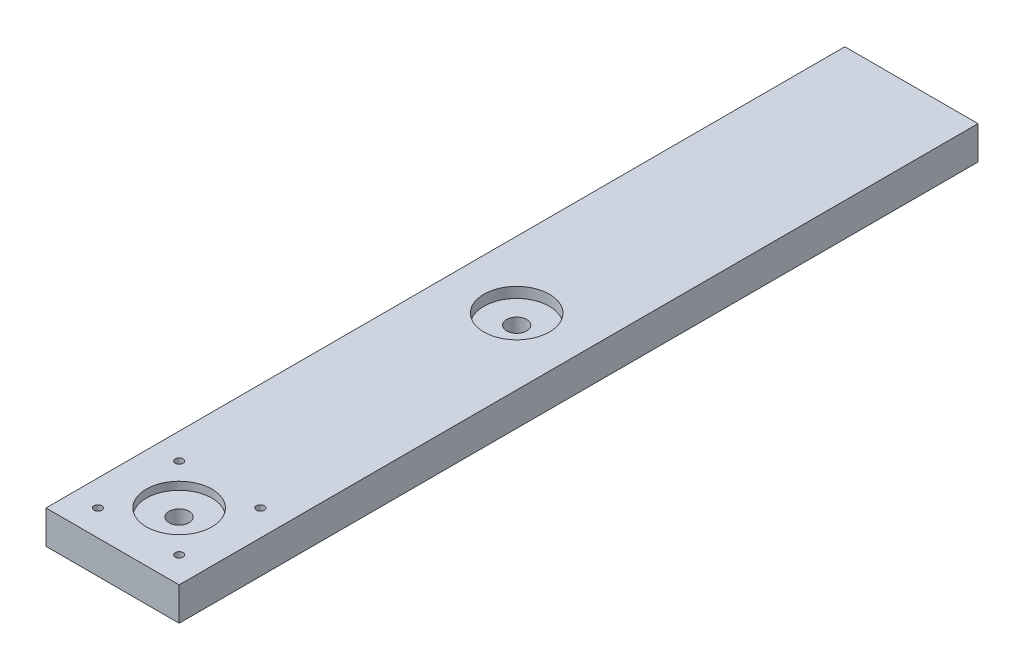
ISO-10303-21;
HEADER;
FILE_DESCRIPTION(('STEP AP214'),'2;1');
FILE_NAME('part.step','',(''),(''),'','','');
FILE_SCHEMA(('AUTOMOTIVE_DESIGN { 1 0 10303 214 1 1 1 1 }'));
ENDSEC;
DATA;
#1=APPLICATION_CONTEXT('core data for automotive mechanical design processes');
#2=APPLICATION_PROTOCOL_DEFINITION('international standard','automotive_design',2000,#1);
#3=PRODUCT_CONTEXT('',#1,'mechanical');
#4=PRODUCT('Part','Part','',(#3));
#5=PRODUCT_RELATED_PRODUCT_CATEGORY('part','',(#4));
#6=PRODUCT_DEFINITION_FORMATION('','',#4);
#7=PRODUCT_DEFINITION_CONTEXT('part definition',#1,'design');
#8=PRODUCT_DEFINITION('design','',#6,#7);
#9=PRODUCT_DEFINITION_SHAPE('','',#8);
#10=(LENGTH_UNIT() NAMED_UNIT(*) SI_UNIT(.MILLI.,.METRE.));
#11=(NAMED_UNIT(*) PLANE_ANGLE_UNIT() SI_UNIT($,.RADIAN.));
#12=(NAMED_UNIT(*) SI_UNIT($,.STERADIAN.) SOLID_ANGLE_UNIT());
#13=UNCERTAINTY_MEASURE_WITH_UNIT(LENGTH_MEASURE(1.E-05),#10,'distance_accuracy_value','');
#14=(GEOMETRIC_REPRESENTATION_CONTEXT(3) GLOBAL_UNCERTAINTY_ASSIGNED_CONTEXT((#13)) GLOBAL_UNIT_ASSIGNED_CONTEXT((#10,
#11,#12)) REPRESENTATION_CONTEXT('',''));
#15=CARTESIAN_POINT('',(0.,0.,0.));
#16=DIRECTION('',(0.,0.,1.));
#17=DIRECTION('',(1.,0.,0.));
#18=AXIS2_PLACEMENT_3D('',#15,#16,#17);
#19=CARTESIAN_POINT('',(0.,54.61,0.));
#20=DIRECTION('',(0.,-1.,0.));
#21=DIRECTION('',(0.,0.,-1.));
#22=AXIS2_PLACEMENT_3D('',#19,#20,#21);
#23=CYLINDRICAL_SURFACE('',#22,3.81);
#24=CARTESIAN_POINT('',(0.,41.91,0.));
#25=DIRECTION('',(0.,-1.,0.));
#26=DIRECTION('',(0.,0.,-1.));
#27=AXIS2_PLACEMENT_3D('',#24,#25,#26);
#28=CIRCLE('',#27,3.81);
#29=CARTESIAN_POINT('',(0.,41.91,-3.81));
#30=VERTEX_POINT('',#29);
#31=EDGE_CURVE('E130',#30,#30,#28,.T.);
#32=ORIENTED_EDGE('',*,*,#31,.T.);
#33=EDGE_LOOP('',(#32));
#34=FACE_BOUND('',#33,.T.);
#35=CARTESIAN_POINT('',(0.,50.61,0.));
#36=DIRECTION('',(0.,1.,0.));
#37=DIRECTION('',(0.,0.,1.));
#38=AXIS2_PLACEMENT_3D('',#35,#36,#37);
#39=CIRCLE('',#38,3.81);
#40=CARTESIAN_POINT('',(0.,50.61,3.81));
#41=VERTEX_POINT('',#40);
#42=EDGE_CURVE('E49',#41,#41,#39,.F.);
#43=ORIENTED_EDGE('',*,*,#42,.F.);
#44=EDGE_LOOP('',(#43));
#45=FACE_BOUND('',#44,.T.);
#46=ADVANCED_FACE('F45',(#34,#45),#23,.F.);
#47=CARTESIAN_POINT('',(0.,72.85,128.777676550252));
#48=DIRECTION('',(0.,-1.,0.));
#49=DIRECTION('',(0.,0.,-1.));
#50=AXIS2_PLACEMENT_3D('',#47,#48,#49);
#51=CYLINDRICAL_SURFACE('',#50,3.81);
#52=CARTESIAN_POINT('',(0.,41.91,128.777676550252));
#53=DIRECTION('',(0.,-1.,0.));
#54=DIRECTION('',(0.,0.,-1.));
#55=AXIS2_PLACEMENT_3D('',#52,#53,#54);
#56=CIRCLE('',#55,3.81);
#57=CARTESIAN_POINT('',(0.,41.91,124.967676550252));
#58=VERTEX_POINT('',#57);
#59=EDGE_CURVE('E147',#58,#58,#56,.T.);
#60=CARTESIAN_POINT('',(0.,51.61,128.777676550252));
#61=DIRECTION('',(0.,1.,0.));
#62=DIRECTION('',(0.,0.,1.));
#63=AXIS2_PLACEMENT_3D('',#60,#61,#62);
#64=CIRCLE('',#63,3.81);
#65=CARTESIAN_POINT('',(0.,51.61,124.967676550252));
#66=VERTEX_POINT('',#65);
#67=EDGE_CURVE('E139',#66,#66,#64,.F.);
#68=CARTESIAN_POINT('',(0.,41.91,124.967676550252));
#69=CARTESIAN_POINT('',(0.,42.0110416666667,124.967676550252));
#70=CARTESIAN_POINT('',(0.,42.1120833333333,124.967676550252));
#71=CARTESIAN_POINT('',(0.,42.3141666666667,124.967676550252));
#72=CARTESIAN_POINT('',(0.,42.4152083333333,124.967676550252));
#73=CARTESIAN_POINT('',(0.,42.6172916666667,124.967676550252));
#74=CARTESIAN_POINT('',(0.,42.7183333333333,124.967676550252));
#75=CARTESIAN_POINT('',(0.,42.9204166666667,124.967676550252));
#76=CARTESIAN_POINT('',(0.,43.0214583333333,124.967676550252));
#77=CARTESIAN_POINT('',(0.,43.2235416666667,124.967676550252));
#78=CARTESIAN_POINT('',(0.,43.3245833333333,124.967676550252));
#79=CARTESIAN_POINT('',(0.,43.5266666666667,124.967676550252));
#80=CARTESIAN_POINT('',(0.,43.6277083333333,124.967676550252));
#81=CARTESIAN_POINT('',(0.,43.8297916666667,124.967676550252));
#82=CARTESIAN_POINT('',(0.,43.9308333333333,124.967676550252));
#83=CARTESIAN_POINT('',(0.,44.1329166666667,124.967676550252));
#84=CARTESIAN_POINT('',(0.,44.2339583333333,124.967676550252));
#85=CARTESIAN_POINT('',(0.,44.4360416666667,124.967676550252));
#86=CARTESIAN_POINT('',(0.,44.5370833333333,124.967676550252));
#87=CARTESIAN_POINT('',(0.,44.7391666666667,124.967676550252));
#88=CARTESIAN_POINT('',(0.,44.8402083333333,124.967676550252));
#89=CARTESIAN_POINT('',(0.,45.0422916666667,124.967676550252));
#90=CARTESIAN_POINT('',(0.,45.1433333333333,124.967676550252));
#91=CARTESIAN_POINT('',(0.,45.3454166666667,124.967676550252));
#92=CARTESIAN_POINT('',(0.,45.4464583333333,124.967676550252));
#93=CARTESIAN_POINT('',(0.,45.6485416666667,124.967676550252));
#94=CARTESIAN_POINT('',(0.,45.7495833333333,124.967676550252));
#95=CARTESIAN_POINT('',(0.,45.9516666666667,124.967676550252));
#96=CARTESIAN_POINT('',(0.,46.0527083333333,124.967676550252));
#97=CARTESIAN_POINT('',(0.,46.2547916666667,124.967676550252));
#98=CARTESIAN_POINT('',(0.,46.3558333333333,124.967676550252));
#99=CARTESIAN_POINT('',(0.,46.5579166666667,124.967676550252));
#100=CARTESIAN_POINT('',(0.,46.6589583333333,124.967676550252));
#101=CARTESIAN_POINT('',(0.,46.8610416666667,124.967676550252));
#102=CARTESIAN_POINT('',(0.,46.9620833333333,124.967676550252));
#103=CARTESIAN_POINT('',(0.,47.1641666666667,124.967676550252));
#104=CARTESIAN_POINT('',(0.,47.2652083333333,124.967676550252));
#105=CARTESIAN_POINT('',(0.,47.4672916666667,124.967676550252));
#106=CARTESIAN_POINT('',(0.,47.5683333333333,124.967676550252));
#107=CARTESIAN_POINT('',(0.,47.7704166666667,124.967676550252));
#108=CARTESIAN_POINT('',(0.,47.8714583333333,124.967676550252));
#109=CARTESIAN_POINT('',(0.,48.0735416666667,124.967676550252));
#110=CARTESIAN_POINT('',(0.,48.1745833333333,124.967676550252));
#111=CARTESIAN_POINT('',(0.,48.3766666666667,124.967676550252));
#112=CARTESIAN_POINT('',(0.,48.4777083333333,124.967676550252));
#113=CARTESIAN_POINT('',(0.,48.6797916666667,124.967676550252));
#114=CARTESIAN_POINT('',(0.,48.7808333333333,124.967676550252));
#115=CARTESIAN_POINT('',(0.,48.9829166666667,124.967676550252));
#116=CARTESIAN_POINT('',(0.,49.0839583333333,124.967676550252));
#117=CARTESIAN_POINT('',(0.,49.2860416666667,124.967676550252));
#118=CARTESIAN_POINT('',(0.,49.3870833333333,124.967676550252));
#119=CARTESIAN_POINT('',(0.,49.5891666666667,124.967676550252));
#120=CARTESIAN_POINT('',(0.,49.6902083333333,124.967676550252));
#121=CARTESIAN_POINT('',(0.,49.8922916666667,124.967676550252));
#122=CARTESIAN_POINT('',(0.,49.9933333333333,124.967676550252));
#123=CARTESIAN_POINT('',(0.,50.1954166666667,124.967676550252));
#124=CARTESIAN_POINT('',(0.,50.2964583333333,124.967676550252));
#125=CARTESIAN_POINT('',(0.,50.4985416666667,124.967676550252));
#126=CARTESIAN_POINT('',(0.,50.5995833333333,124.967676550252));
#127=CARTESIAN_POINT('',(0.,50.8016666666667,124.967676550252));
#128=CARTESIAN_POINT('',(0.,50.9027083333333,124.967676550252));
#129=CARTESIAN_POINT('',(0.,51.1047916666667,124.967676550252));
#130=CARTESIAN_POINT('',(0.,51.2058333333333,124.967676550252));
#131=CARTESIAN_POINT('',(0.,51.4079166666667,124.967676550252));
#132=CARTESIAN_POINT('',(0.,51.5089583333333,124.967676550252));
#133=CARTESIAN_POINT('',(0.,51.61,124.967676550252));
#134=B_SPLINE_CURVE_WITH_KNOTS('',3,(#68,#69,#70,#71,#72,#73,#74,#75,#76,#77,#78,#79,#80,#81,
#82,#83,#84,#85,#86,#87,#88,#89,#90,#91,#92,#93,#94,#95,#96,#97,#98,#99,#100,#101,#102,#103,
#104,#105,#106,#107,#108,#109,#110,#111,#112,#113,#114,#115,#116,#117,#118,#119,#120,#121,#122,
#123,#124,#125,#126,#127,#128,#129,#130,#131,#132,#133),.UNSPECIFIED.,.F.,.F.,(4,2,2,2,2,2,2,2,
2,2,2,2,2,2,2,2,2,2,2,2,2,2,2,2,2,2,2,2,2,2,2,2,4),(0.,0.303125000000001,0.606249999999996,
0.90937499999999,1.21249999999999,1.51562499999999,1.81874999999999,2.121875,2.425,2.728125,
3.03124999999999,3.33437499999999,3.63749999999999,3.94062499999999,4.24374999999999,
4.54687499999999,4.84999999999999,5.15312499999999,5.45624999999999,5.75937499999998,
6.06249999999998,6.36562499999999,6.66874999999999,6.97187499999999,7.27499999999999,
7.57812499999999,7.88124999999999,8.18437499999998,8.48749999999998,8.79062499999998,
9.09374999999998,9.39687499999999,9.69999999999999),.UNSPECIFIED.);
#135=EDGE_CURVE('BSEAM196',#58,#66,#134,.T.);
#136=ORIENTED_EDGE('',*,*,#59,.T.);
#137=ORIENTED_EDGE('',*,*,#67,.F.);
#138=ORIENTED_EDGE('',*,*,#135,.T.);
#139=ORIENTED_EDGE('',*,*,#135,.F.);
#140=EDGE_LOOP('',(#136,#138,#137,#139));
#141=FACE_BOUND('',#140,.T.);
#142=ADVANCED_FACE('F196',(#141),#51,.F.);
#143=CARTESIAN_POINT('',(-25.4,54.61,-23.6223234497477));
#144=DIRECTION('',(1.,0.,0.));
#145=DIRECTION('',(0.,0.,-1.));
#146=AXIS2_PLACEMENT_3D('',#143,#144,#145);
#147=PLANE('',#146);
#148=DIRECTION('',(0.,0.,1.));
#149=VECTOR('',#148,1.);
#150=CARTESIAN_POINT('',(-25.4,41.91,-23.6223234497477));
#151=LINE('',#150,#149);
#152=CARTESIAN_POINT('',(-25.4,41.91,-150.622323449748));
#153=VERTEX_POINT('',#152);
#154=CARTESIAN_POINT('',(-25.4,41.91,154.177676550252));
#155=VERTEX_POINT('',#154);
#156=EDGE_CURVE('E76',#153,#155,#151,.T.);
#157=ORIENTED_EDGE('',*,*,#156,.T.);
#158=DIRECTION('',(0.,-1.,0.));
#159=VECTOR('',#158,1.);
#160=CARTESIAN_POINT('',(-25.4,54.61,154.177676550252));
#161=LINE('',#160,#159);
#162=CARTESIAN_POINT('',(-25.4,54.61,154.177676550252));
#163=VERTEX_POINT('',#162);
#164=EDGE_CURVE('E11',#163,#155,#161,.T.);
#165=ORIENTED_EDGE('',*,*,#164,.F.);
#166=DIRECTION('',(0.,0.,1.));
#167=VECTOR('',#166,1.);
#168=CARTESIAN_POINT('',(-25.4,54.61,-23.6223234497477));
#169=LINE('',#168,#167);
#170=CARTESIAN_POINT('',(-25.4,54.61,-150.622323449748));
#171=VERTEX_POINT('',#170);
#172=EDGE_CURVE('E102',#171,#163,#169,.T.);
#173=ORIENTED_EDGE('',*,*,#172,.F.);
#174=DIRECTION('',(0.,1.,0.));
#175=VECTOR('',#174,1.);
#176=CARTESIAN_POINT('',(-25.4,41.91,-150.622323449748));
#177=LINE('',#176,#175);
#178=EDGE_CURVE('E111',#153,#171,#177,.T.);
#179=ORIENTED_EDGE('',*,*,#178,.F.);
#180=EDGE_LOOP('',(#157,#165,#173,#179));
#181=FACE_BOUND('',#180,.T.);
#182=ADVANCED_FACE('F47',(#181),#147,.F.);
#183=CARTESIAN_POINT('',(-25.4,54.61,154.177676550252));
#184=DIRECTION('',(0.,0.,-1.));
#185=DIRECTION('',(-1.,0.,0.));
#186=AXIS2_PLACEMENT_3D('',#183,#184,#185);
#187=PLANE('',#186);
#188=DIRECTION('',(1.,0.,0.));
#189=VECTOR('',#188,1.);
#190=CARTESIAN_POINT('',(-25.4,41.91,154.177676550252));
#191=LINE('',#190,#189);
#192=CARTESIAN_POINT('',(25.4,41.91,154.177676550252));
#193=VERTEX_POINT('',#192);
#194=EDGE_CURVE('E103',#155,#193,#191,.T.);
#195=ORIENTED_EDGE('',*,*,#194,.T.);
#196=DIRECTION('',(0.,-1.,0.));
#197=VECTOR('',#196,1.);
#198=CARTESIAN_POINT('',(25.4,54.61,154.177676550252));
#199=LINE('',#198,#197);
#200=CARTESIAN_POINT('',(25.4,54.61,154.177676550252));
#201=VERTEX_POINT('',#200);
#202=EDGE_CURVE('E56',#201,#193,#199,.T.);
#203=ORIENTED_EDGE('',*,*,#202,.F.);
#204=DIRECTION('',(1.,0.,0.));
#205=VECTOR('',#204,1.);
#206=CARTESIAN_POINT('',(-25.4,54.61,154.177676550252));
#207=LINE('',#206,#205);
#208=EDGE_CURVE('E65',#163,#201,#207,.T.);
#209=ORIENTED_EDGE('',*,*,#208,.F.);
#210=ORIENTED_EDGE('',*,*,#164,.T.);
#211=EDGE_LOOP('',(#195,#203,#209,#210));
#212=FACE_BOUND('',#211,.T.);
#213=ADVANCED_FACE('F205',(#212),#187,.F.);
#214=CARTESIAN_POINT('',(25.4,54.61,-23.6223234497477));
#215=DIRECTION('',(-1.,0.,0.));
#216=DIRECTION('',(0.,0.,1.));
#217=AXIS2_PLACEMENT_3D('',#214,#215,#216);
#218=PLANE('',#217);
#219=DIRECTION('',(0.,0.,-1.));
#220=VECTOR('',#219,1.);
#221=CARTESIAN_POINT('',(25.4,41.91,-23.6223234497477));
#222=LINE('',#221,#220);
#223=CARTESIAN_POINT('',(25.4,41.91,-150.622323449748));
#224=VERTEX_POINT('',#223);
#225=EDGE_CURVE('E95',#193,#224,#222,.T.);
#226=ORIENTED_EDGE('',*,*,#225,.T.);
#227=DIRECTION('',(0.,-1.,0.));
#228=VECTOR('',#227,1.);
#229=CARTESIAN_POINT('',(25.4,41.91,-150.622323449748));
#230=LINE('',#229,#228);
#231=CARTESIAN_POINT('',(25.4,54.61,-150.622323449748));
#232=VERTEX_POINT('',#231);
#233=EDGE_CURVE('E99',#232,#224,#230,.T.);
#234=ORIENTED_EDGE('',*,*,#233,.F.);
#235=DIRECTION('',(0.,0.,-1.));
#236=VECTOR('',#235,1.);
#237=CARTESIAN_POINT('',(25.4,54.61,-23.6223234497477));
#238=LINE('',#237,#236);
#239=EDGE_CURVE('E82',#201,#232,#238,.T.);
#240=ORIENTED_EDGE('',*,*,#239,.F.);
#241=ORIENTED_EDGE('',*,*,#202,.T.);
#242=EDGE_LOOP('',(#226,#234,#240,#241));
#243=FACE_BOUND('',#242,.T.);
#244=ADVANCED_FACE('F97',(#243),#218,.F.);
#245=CARTESIAN_POINT('',(0.,54.61,0.));
#246=DIRECTION('',(0.,1.,0.));
#247=DIRECTION('',(0.,0.,1.));
#248=AXIS2_PLACEMENT_3D('',#245,#246,#247);
#249=PLANE('',#248);
#250=CARTESIAN_POINT('',(0.,54.61,0.));
#251=DIRECTION('',(0.,1.,0.));
#252=DIRECTION('',(0.,0.,1.));
#253=AXIS2_PLACEMENT_3D('',#250,#251,#252);
#254=CIRCLE('',#253,12.5);
#255=CARTESIAN_POINT('',(0.,54.61,12.5));
#256=VERTEX_POINT('',#255);
#257=EDGE_CURVE('E122',#256,#256,#254,.T.);
#258=ORIENTED_EDGE('',*,*,#257,.F.);
#259=EDGE_LOOP('',(#258));
#260=FACE_BOUND('',#259,.T.);
#261=CARTESIAN_POINT('',(0.,54.61,128.777676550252));
#262=DIRECTION('',(0.,1.,0.));
#263=DIRECTION('',(0.,0.,1.));
#264=AXIS2_PLACEMENT_3D('',#261,#262,#263);
#265=CIRCLE('',#264,12.5);
#266=CARTESIAN_POINT('',(0.,54.61,141.277676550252));
#267=VERTEX_POINT('',#266);
#268=EDGE_CURVE('E134',#267,#267,#265,.T.);
#269=ORIENTED_EDGE('',*,*,#268,.F.);
#270=EDGE_LOOP('',(#269));
#271=FACE_BOUND('',#270,.T.);
#272=CARTESIAN_POINT('',(-15.5,54.61,113.277676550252));
#273=DIRECTION('',(0.,1.,0.));
#274=DIRECTION('',(0.,0.,1.));
#275=AXIS2_PLACEMENT_3D('',#272,#273,#274);
#276=CIRCLE('',#275,1.5);
#277=CARTESIAN_POINT('',(-15.5,54.61,111.777676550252));
#278=VERTEX_POINT('',#277);
#279=EDGE_CURVE('E175',#278,#278,#276,.T.);
#280=ORIENTED_EDGE('',*,*,#279,.F.);
#281=EDGE_LOOP('',(#280));
#282=FACE_BOUND('',#281,.T.);
#283=CARTESIAN_POINT('',(-15.5,54.61,144.277676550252));
#284=DIRECTION('',(0.,1.,0.));
#285=DIRECTION('',(0.,0.,1.));
#286=AXIS2_PLACEMENT_3D('',#283,#284,#285);
#287=CIRCLE('',#286,1.5);
#288=CARTESIAN_POINT('',(-15.5,54.61,142.777676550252));
#289=VERTEX_POINT('',#288);
#290=EDGE_CURVE('E171',#289,#289,#287,.T.);
#291=ORIENTED_EDGE('',*,*,#290,.F.);
#292=EDGE_LOOP('',(#291));
#293=FACE_BOUND('',#292,.T.);
#294=CARTESIAN_POINT('',(15.5,54.61,144.277676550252));
#295=DIRECTION('',(0.,1.,0.));
#296=DIRECTION('',(0.,0.,1.));
#297=AXIS2_PLACEMENT_3D('',#294,#295,#296);
#298=CIRCLE('',#297,1.5);
#299=CARTESIAN_POINT('',(15.5,54.61,142.777676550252));
#300=VERTEX_POINT('',#299);
#301=EDGE_CURVE('E167',#300,#300,#298,.T.);
#302=ORIENTED_EDGE('',*,*,#301,.F.);
#303=EDGE_LOOP('',(#302));
#304=FACE_BOUND('',#303,.T.);
#305=CARTESIAN_POINT('',(15.5,54.61,113.277676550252));
#306=DIRECTION('',(0.,1.,0.));
#307=DIRECTION('',(0.,0.,1.));
#308=AXIS2_PLACEMENT_3D('',#305,#306,#307);
#309=CIRCLE('',#308,1.5);
#310=CARTESIAN_POINT('',(15.5,54.61,111.777676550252));
#311=VERTEX_POINT('',#310);
#312=EDGE_CURVE('E163',#311,#311,#309,.T.);
#313=ORIENTED_EDGE('',*,*,#312,.F.);
#314=EDGE_LOOP('',(#313));
#315=FACE_BOUND('',#314,.T.);
#316=ORIENTED_EDGE('',*,*,#172,.T.);
#317=ORIENTED_EDGE('',*,*,#208,.T.);
#318=ORIENTED_EDGE('',*,*,#239,.T.);
#319=DIRECTION('',(1.,0.,0.));
#320=VECTOR('',#319,1.);
#321=CARTESIAN_POINT('',(25.4,54.61,-150.622323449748));
#322=LINE('',#321,#320);
#323=EDGE_CURVE('E114',#171,#232,#322,.T.);
#324=ORIENTED_EDGE('',*,*,#323,.F.);
#325=EDGE_LOOP('',(#316,#317,#318,#324));
#326=FACE_BOUND('',#325,.T.);
#327=ADVANCED_FACE('F213',(#260,#271,#282,#293,#304,#315,#326),#249,.T.);
#328=CARTESIAN_POINT('',(0.,41.91,0.));
#329=DIRECTION('',(0.,1.,0.));
#330=DIRECTION('',(0.,0.,1.));
#331=AXIS2_PLACEMENT_3D('',#328,#329,#330);
#332=PLANE('',#331);
#333=ORIENTED_EDGE('',*,*,#31,.F.);
#334=EDGE_LOOP('',(#333));
#335=FACE_BOUND('',#334,.T.);
#336=CARTESIAN_POINT('',(-15.5,41.91,113.277676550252));
#337=DIRECTION('',(0.,-1.,0.));
#338=DIRECTION('',(0.,0.,-1.));
#339=AXIS2_PLACEMENT_3D('',#336,#337,#338);
#340=CIRCLE('',#339,1.5);
#341=CARTESIAN_POINT('',(-15.5,41.91,111.777676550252));
#342=VERTEX_POINT('',#341);
#343=EDGE_CURVE('E156',#342,#342,#340,.T.);
#344=ORIENTED_EDGE('',*,*,#343,.F.);
#345=EDGE_LOOP('',(#344));
#346=FACE_BOUND('',#345,.T.);
#347=CARTESIAN_POINT('',(-15.5,41.91,144.277676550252));
#348=DIRECTION('',(0.,-1.,0.));
#349=DIRECTION('',(0.,0.,-1.));
#350=AXIS2_PLACEMENT_3D('',#347,#348,#349);
#351=CIRCLE('',#350,1.5);
#352=CARTESIAN_POINT('',(-15.5,41.91,142.777676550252));
#353=VERTEX_POINT('',#352);
#354=EDGE_CURVE('E152',#353,#353,#351,.T.);
#355=ORIENTED_EDGE('',*,*,#354,.F.);
#356=EDGE_LOOP('',(#355));
#357=FACE_BOUND('',#356,.T.);
#358=CARTESIAN_POINT('',(15.5,41.91,144.277676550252));
#359=DIRECTION('',(0.,-1.,0.));
#360=DIRECTION('',(0.,0.,-1.));
#361=AXIS2_PLACEMENT_3D('',#358,#359,#360);
#362=CIRCLE('',#361,1.5);
#363=CARTESIAN_POINT('',(15.5,41.91,142.777676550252));
#364=VERTEX_POINT('',#363);
#365=EDGE_CURVE('E148',#364,#364,#362,.T.);
#366=ORIENTED_EDGE('',*,*,#365,.F.);
#367=EDGE_LOOP('',(#366));
#368=FACE_BOUND('',#367,.T.);
#369=CARTESIAN_POINT('',(15.5,41.91,113.277676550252));
#370=DIRECTION('',(0.,-1.,0.));
#371=DIRECTION('',(0.,0.,-1.));
#372=AXIS2_PLACEMENT_3D('',#369,#370,#371);
#373=CIRCLE('',#372,1.5);
#374=CARTESIAN_POINT('',(15.5,41.91,111.777676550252));
#375=VERTEX_POINT('',#374);
#376=EDGE_CURVE('E143',#375,#375,#373,.T.);
#377=ORIENTED_EDGE('',*,*,#376,.F.);
#378=EDGE_LOOP('',(#377));
#379=FACE_BOUND('',#378,.T.);
#380=ORIENTED_EDGE('',*,*,#59,.F.);
#381=EDGE_LOOP('',(#380));
#382=FACE_BOUND('',#381,.T.);
#383=ORIENTED_EDGE('',*,*,#194,.F.);
#384=ORIENTED_EDGE('',*,*,#156,.F.);
#385=DIRECTION('',(-1.,0.,0.));
#386=VECTOR('',#385,1.);
#387=CARTESIAN_POINT('',(25.4,41.91,-150.622323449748));
#388=LINE('',#387,#386);
#389=EDGE_CURVE('E106',#224,#153,#388,.T.);
#390=ORIENTED_EDGE('',*,*,#389,.F.);
#391=ORIENTED_EDGE('',*,*,#225,.F.);
#392=EDGE_LOOP('',(#383,#384,#390,#391));
#393=FACE_BOUND('',#392,.T.);
#394=ADVANCED_FACE('F107',(#335,#346,#357,#368,#379,#382,#393),#332,.F.);
#395=CARTESIAN_POINT('',(15.5,72.85,113.277676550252));
#396=DIRECTION('',(0.,-1.,0.));
#397=DIRECTION('',(0.,0.,-1.));
#398=AXIS2_PLACEMENT_3D('',#395,#396,#397);
#399=CYLINDRICAL_SURFACE('',#398,1.5);
#400=CARTESIAN_POINT('',(15.5,54.61,111.777676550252));
#401=CARTESIAN_POINT('',(15.5,54.4777083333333,111.777676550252));
#402=CARTESIAN_POINT('',(15.5,54.3454166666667,111.777676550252));
#403=CARTESIAN_POINT('',(15.5,54.0808333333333,111.777676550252));
#404=CARTESIAN_POINT('',(15.5,53.9485416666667,111.777676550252));
#405=CARTESIAN_POINT('',(15.5,53.6839583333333,111.777676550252));
#406=CARTESIAN_POINT('',(15.5,53.5516666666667,111.777676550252));
#407=CARTESIAN_POINT('',(15.5,53.2870833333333,111.777676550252));
#408=CARTESIAN_POINT('',(15.5,53.1547916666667,111.777676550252));
#409=CARTESIAN_POINT('',(15.5,52.8902083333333,111.777676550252));
#410=CARTESIAN_POINT('',(15.5,52.7579166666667,111.777676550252));
#411=CARTESIAN_POINT('',(15.5,52.4933333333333,111.777676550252));
#412=CARTESIAN_POINT('',(15.5,52.3610416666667,111.777676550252));
#413=CARTESIAN_POINT('',(15.5,52.0964583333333,111.777676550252));
#414=CARTESIAN_POINT('',(15.5,51.9641666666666,111.777676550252));
#415=CARTESIAN_POINT('',(15.5,51.6995833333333,111.777676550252));
#416=CARTESIAN_POINT('',(15.5,51.5672916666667,111.777676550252));
#417=CARTESIAN_POINT('',(15.5,51.3027083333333,111.777676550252));
#418=CARTESIAN_POINT('',(15.5,51.1704166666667,111.777676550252));
#419=CARTESIAN_POINT('',(15.5,50.9058333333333,111.777676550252));
#420=CARTESIAN_POINT('',(15.5,50.7735416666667,111.777676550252));
#421=CARTESIAN_POINT('',(15.5,50.5089583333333,111.777676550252));
#422=CARTESIAN_POINT('',(15.5,50.3766666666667,111.777676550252));
#423=CARTESIAN_POINT('',(15.5,50.1120833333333,111.777676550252));
#424=CARTESIAN_POINT('',(15.5,49.9797916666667,111.777676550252));
#425=CARTESIAN_POINT('',(15.5,49.7152083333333,111.777676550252));
#426=CARTESIAN_POINT('',(15.5,49.5829166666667,111.777676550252));
#427=CARTESIAN_POINT('',(15.5,49.3183333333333,111.777676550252));
#428=CARTESIAN_POINT('',(15.5,49.1860416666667,111.777676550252));
#429=CARTESIAN_POINT('',(15.5,48.9214583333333,111.777676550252));
#430=CARTESIAN_POINT('',(15.5,48.7891666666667,111.777676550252));
#431=CARTESIAN_POINT('',(15.5,48.5245833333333,111.777676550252));
#432=CARTESIAN_POINT('',(15.5,48.3922916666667,111.777676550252));
#433=CARTESIAN_POINT('',(15.5,48.1277083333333,111.777676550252));
#434=CARTESIAN_POINT('',(15.5,47.9954166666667,111.777676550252));
#435=CARTESIAN_POINT('',(15.5,47.7308333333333,111.777676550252));
#436=CARTESIAN_POINT('',(15.5,47.5985416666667,111.777676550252));
#437=CARTESIAN_POINT('',(15.5,47.3339583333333,111.777676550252));
#438=CARTESIAN_POINT('',(15.5,47.2016666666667,111.777676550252));
#439=CARTESIAN_POINT('',(15.5,46.9370833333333,111.777676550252));
#440=CARTESIAN_POINT('',(15.5,46.8047916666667,111.777676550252));
#441=CARTESIAN_POINT('',(15.5,46.5402083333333,111.777676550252));
#442=CARTESIAN_POINT('',(15.5,46.4079166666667,111.777676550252));
#443=CARTESIAN_POINT('',(15.5,46.1433333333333,111.777676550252));
#444=CARTESIAN_POINT('',(15.5,46.0110416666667,111.777676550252));
#445=CARTESIAN_POINT('',(15.5,45.7464583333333,111.777676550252));
#446=CARTESIAN_POINT('',(15.5,45.6141666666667,111.777676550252));
#447=CARTESIAN_POINT('',(15.5,45.3495833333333,111.777676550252));
#448=CARTESIAN_POINT('',(15.5,45.2172916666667,111.777676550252));
#449=CARTESIAN_POINT('',(15.5,44.9527083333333,111.777676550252));
#450=CARTESIAN_POINT('',(15.5,44.8204166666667,111.777676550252));
#451=CARTESIAN_POINT('',(15.5,44.5558333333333,111.777676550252));
#452=CARTESIAN_POINT('',(15.5,44.4235416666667,111.777676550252));
#453=CARTESIAN_POINT('',(15.5,44.1589583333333,111.777676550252));
#454=CARTESIAN_POINT('',(15.5,44.0266666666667,111.777676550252));
#455=CARTESIAN_POINT('',(15.5,43.7620833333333,111.777676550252));
#456=CARTESIAN_POINT('',(15.5,43.6297916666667,111.777676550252));
#457=CARTESIAN_POINT('',(15.5,43.3652083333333,111.777676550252));
#458=CARTESIAN_POINT('',(15.5,43.2329166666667,111.777676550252));
#459=CARTESIAN_POINT('',(15.5,42.9683333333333,111.777676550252));
#460=CARTESIAN_POINT('',(15.5,42.8360416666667,111.777676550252));
#461=CARTESIAN_POINT('',(15.5,42.5714583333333,111.777676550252));
#462=CARTESIAN_POINT('',(15.5,42.4391666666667,111.777676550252));
#463=CARTESIAN_POINT('',(15.5,42.1745833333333,111.777676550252));
#464=CARTESIAN_POINT('',(15.5,42.0422916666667,111.777676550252));
#465=CARTESIAN_POINT('',(15.5,41.91,111.777676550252));
#466=B_SPLINE_CURVE_WITH_KNOTS('',3,(#400,#401,#402,#403,#404,#405,#406,#407,#408,#409,#410,
#411,#412,#413,#414,#415,#416,#417,#418,#419,#420,#421,#422,#423,#424,#425,#426,#427,#428,#429,
#430,#431,#432,#433,#434,#435,#436,#437,#438,#439,#440,#441,#442,#443,#444,#445,#446,#447,#448,
#449,#450,#451,#452,#453,#454,#455,#456,#457,#458,#459,#460,#461,#462,#463,#464,#465),
.UNSPECIFIED.,.F.,.F.,(4,2,2,2,2,2,2,2,2,2,2,2,2,2,2,2,2,2,2,2,2,2,2,2,2,2,2,2,2,2,2,2,4),(0.,
0.396875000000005,0.793750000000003,1.190625,1.58750000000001,1.984375,2.38125,2.77812500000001,
3.175,3.571875,3.96875,4.365625,4.7625,5.15937499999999,5.55625,5.953125,6.34999999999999,
6.746875,7.14375,7.540625,7.9375,8.33437499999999,8.73125,9.128125,9.52499999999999,9.921875,
10.31875,10.715625,11.1125,11.509375,11.90625,12.303125,12.7),.UNSPECIFIED.);
#467=EDGE_CURVE('BSEAM219',#311,#375,#466,.T.);
#468=ORIENTED_EDGE('',*,*,#312,.T.);
#469=ORIENTED_EDGE('',*,*,#376,.T.);
#470=ORIENTED_EDGE('',*,*,#467,.T.);
#471=ORIENTED_EDGE('',*,*,#467,.F.);
#472=EDGE_LOOP('',(#468,#470,#469,#471));
#473=FACE_BOUND('',#472,.T.);
#474=ADVANCED_FACE('F219',(#473),#399,.F.);
#475=CARTESIAN_POINT('',(15.5,72.85,144.277676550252));
#476=DIRECTION('',(0.,-1.,0.));
#477=DIRECTION('',(0.,0.,-1.));
#478=AXIS2_PLACEMENT_3D('',#475,#476,#477);
#479=CYLINDRICAL_SURFACE('',#478,1.5);
#480=CARTESIAN_POINT('',(15.5,54.61,142.777676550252));
#481=CARTESIAN_POINT('',(15.5,54.4777083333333,142.777676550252));
#482=CARTESIAN_POINT('',(15.5,54.3454166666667,142.777676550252));
#483=CARTESIAN_POINT('',(15.5,54.0808333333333,142.777676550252));
#484=CARTESIAN_POINT('',(15.5,53.9485416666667,142.777676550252));
#485=CARTESIAN_POINT('',(15.5,53.6839583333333,142.777676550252));
#486=CARTESIAN_POINT('',(15.5,53.5516666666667,142.777676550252));
#487=CARTESIAN_POINT('',(15.5,53.2870833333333,142.777676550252));
#488=CARTESIAN_POINT('',(15.5,53.1547916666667,142.777676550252));
#489=CARTESIAN_POINT('',(15.5,52.8902083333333,142.777676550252));
#490=CARTESIAN_POINT('',(15.5,52.7579166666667,142.777676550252));
#491=CARTESIAN_POINT('',(15.5,52.4933333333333,142.777676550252));
#492=CARTESIAN_POINT('',(15.5,52.3610416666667,142.777676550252));
#493=CARTESIAN_POINT('',(15.5,52.0964583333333,142.777676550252));
#494=CARTESIAN_POINT('',(15.5,51.9641666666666,142.777676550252));
#495=CARTESIAN_POINT('',(15.5,51.6995833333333,142.777676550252));
#496=CARTESIAN_POINT('',(15.5,51.5672916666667,142.777676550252));
#497=CARTESIAN_POINT('',(15.5,51.3027083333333,142.777676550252));
#498=CARTESIAN_POINT('',(15.5,51.1704166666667,142.777676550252));
#499=CARTESIAN_POINT('',(15.5,50.9058333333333,142.777676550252));
#500=CARTESIAN_POINT('',(15.5,50.7735416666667,142.777676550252));
#501=CARTESIAN_POINT('',(15.5,50.5089583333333,142.777676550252));
#502=CARTESIAN_POINT('',(15.5,50.3766666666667,142.777676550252));
#503=CARTESIAN_POINT('',(15.5,50.1120833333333,142.777676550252));
#504=CARTESIAN_POINT('',(15.5,49.9797916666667,142.777676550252));
#505=CARTESIAN_POINT('',(15.5,49.7152083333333,142.777676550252));
#506=CARTESIAN_POINT('',(15.5,49.5829166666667,142.777676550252));
#507=CARTESIAN_POINT('',(15.5,49.3183333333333,142.777676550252));
#508=CARTESIAN_POINT('',(15.5,49.1860416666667,142.777676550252));
#509=CARTESIAN_POINT('',(15.5,48.9214583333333,142.777676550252));
#510=CARTESIAN_POINT('',(15.5,48.7891666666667,142.777676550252));
#511=CARTESIAN_POINT('',(15.5,48.5245833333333,142.777676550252));
#512=CARTESIAN_POINT('',(15.5,48.3922916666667,142.777676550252));
#513=CARTESIAN_POINT('',(15.5,48.1277083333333,142.777676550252));
#514=CARTESIAN_POINT('',(15.5,47.9954166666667,142.777676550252));
#515=CARTESIAN_POINT('',(15.5,47.7308333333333,142.777676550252));
#516=CARTESIAN_POINT('',(15.5,47.5985416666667,142.777676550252));
#517=CARTESIAN_POINT('',(15.5,47.3339583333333,142.777676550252));
#518=CARTESIAN_POINT('',(15.5,47.2016666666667,142.777676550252));
#519=CARTESIAN_POINT('',(15.5,46.9370833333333,142.777676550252));
#520=CARTESIAN_POINT('',(15.5,46.8047916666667,142.777676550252));
#521=CARTESIAN_POINT('',(15.5,46.5402083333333,142.777676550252));
#522=CARTESIAN_POINT('',(15.5,46.4079166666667,142.777676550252));
#523=CARTESIAN_POINT('',(15.5,46.1433333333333,142.777676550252));
#524=CARTESIAN_POINT('',(15.5,46.0110416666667,142.777676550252));
#525=CARTESIAN_POINT('',(15.5,45.7464583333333,142.777676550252));
#526=CARTESIAN_POINT('',(15.5,45.6141666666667,142.777676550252));
#527=CARTESIAN_POINT('',(15.5,45.3495833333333,142.777676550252));
#528=CARTESIAN_POINT('',(15.5,45.2172916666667,142.777676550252));
#529=CARTESIAN_POINT('',(15.5,44.9527083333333,142.777676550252));
#530=CARTESIAN_POINT('',(15.5,44.8204166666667,142.777676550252));
#531=CARTESIAN_POINT('',(15.5,44.5558333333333,142.777676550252));
#532=CARTESIAN_POINT('',(15.5,44.4235416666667,142.777676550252));
#533=CARTESIAN_POINT('',(15.5,44.1589583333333,142.777676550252));
#534=CARTESIAN_POINT('',(15.5,44.0266666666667,142.777676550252));
#535=CARTESIAN_POINT('',(15.5,43.7620833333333,142.777676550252));
#536=CARTESIAN_POINT('',(15.5,43.6297916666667,142.777676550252));
#537=CARTESIAN_POINT('',(15.5,43.3652083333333,142.777676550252));
#538=CARTESIAN_POINT('',(15.5,43.2329166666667,142.777676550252));
#539=CARTESIAN_POINT('',(15.5,42.9683333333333,142.777676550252));
#540=CARTESIAN_POINT('',(15.5,42.8360416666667,142.777676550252));
#541=CARTESIAN_POINT('',(15.5,42.5714583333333,142.777676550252));
#542=CARTESIAN_POINT('',(15.5,42.4391666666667,142.777676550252));
#543=CARTESIAN_POINT('',(15.5,42.1745833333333,142.777676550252));
#544=CARTESIAN_POINT('',(15.5,42.0422916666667,142.777676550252));
#545=CARTESIAN_POINT('',(15.5,41.91,142.777676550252));
#546=B_SPLINE_CURVE_WITH_KNOTS('',3,(#480,#481,#482,#483,#484,#485,#486,#487,#488,#489,#490,
#491,#492,#493,#494,#495,#496,#497,#498,#499,#500,#501,#502,#503,#504,#505,#506,#507,#508,#509,
#510,#511,#512,#513,#514,#515,#516,#517,#518,#519,#520,#521,#522,#523,#524,#525,#526,#527,#528,
#529,#530,#531,#532,#533,#534,#535,#536,#537,#538,#539,#540,#541,#542,#543,#544,#545),
.UNSPECIFIED.,.F.,.F.,(4,2,2,2,2,2,2,2,2,2,2,2,2,2,2,2,2,2,2,2,2,2,2,2,2,2,2,2,2,2,2,2,4),(0.,
0.396875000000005,0.793750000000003,1.190625,1.58750000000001,1.984375,2.38125,2.77812500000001,
3.175,3.571875,3.96875,4.365625,4.7625,5.15937499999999,5.55625,5.953125,6.34999999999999,
6.746875,7.14375,7.540625,7.9375,8.33437499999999,8.73125,9.128125,9.52499999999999,9.921875,
10.31875,10.715625,11.1125,11.509375,11.90625,12.303125,12.7),.UNSPECIFIED.);
#547=EDGE_CURVE('BSEAM235',#300,#364,#546,.T.);
#548=ORIENTED_EDGE('',*,*,#301,.T.);
#549=ORIENTED_EDGE('',*,*,#365,.T.);
#550=ORIENTED_EDGE('',*,*,#547,.T.);
#551=ORIENTED_EDGE('',*,*,#547,.F.);
#552=EDGE_LOOP('',(#548,#550,#549,#551));
#553=FACE_BOUND('',#552,.T.);
#554=ADVANCED_FACE('F235',(#553),#479,.F.);
#555=CARTESIAN_POINT('',(-15.5,72.85,144.277676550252));
#556=DIRECTION('',(0.,-1.,0.));
#557=DIRECTION('',(0.,0.,-1.));
#558=AXIS2_PLACEMENT_3D('',#555,#556,#557);
#559=CYLINDRICAL_SURFACE('',#558,1.5);
#560=CARTESIAN_POINT('',(-15.5,54.61,142.777676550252));
#561=CARTESIAN_POINT('',(-15.5,54.4777083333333,142.777676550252));
#562=CARTESIAN_POINT('',(-15.5,54.3454166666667,142.777676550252));
#563=CARTESIAN_POINT('',(-15.5,54.0808333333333,142.777676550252));
#564=CARTESIAN_POINT('',(-15.5,53.9485416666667,142.777676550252));
#565=CARTESIAN_POINT('',(-15.5,53.6839583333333,142.777676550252));
#566=CARTESIAN_POINT('',(-15.5,53.5516666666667,142.777676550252));
#567=CARTESIAN_POINT('',(-15.5,53.2870833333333,142.777676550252));
#568=CARTESIAN_POINT('',(-15.5,53.1547916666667,142.777676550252));
#569=CARTESIAN_POINT('',(-15.5,52.8902083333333,142.777676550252));
#570=CARTESIAN_POINT('',(-15.5,52.7579166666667,142.777676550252));
#571=CARTESIAN_POINT('',(-15.5,52.4933333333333,142.777676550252));
#572=CARTESIAN_POINT('',(-15.5,52.3610416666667,142.777676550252));
#573=CARTESIAN_POINT('',(-15.5,52.0964583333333,142.777676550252));
#574=CARTESIAN_POINT('',(-15.5,51.9641666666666,142.777676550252));
#575=CARTESIAN_POINT('',(-15.5,51.6995833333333,142.777676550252));
#576=CARTESIAN_POINT('',(-15.5,51.5672916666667,142.777676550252));
#577=CARTESIAN_POINT('',(-15.5,51.3027083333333,142.777676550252));
#578=CARTESIAN_POINT('',(-15.5,51.1704166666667,142.777676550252));
#579=CARTESIAN_POINT('',(-15.5,50.9058333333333,142.777676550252));
#580=CARTESIAN_POINT('',(-15.5,50.7735416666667,142.777676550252));
#581=CARTESIAN_POINT('',(-15.5,50.5089583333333,142.777676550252));
#582=CARTESIAN_POINT('',(-15.5,50.3766666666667,142.777676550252));
#583=CARTESIAN_POINT('',(-15.5,50.1120833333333,142.777676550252));
#584=CARTESIAN_POINT('',(-15.5,49.9797916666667,142.777676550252));
#585=CARTESIAN_POINT('',(-15.5,49.7152083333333,142.777676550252));
#586=CARTESIAN_POINT('',(-15.5,49.5829166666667,142.777676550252));
#587=CARTESIAN_POINT('',(-15.5,49.3183333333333,142.777676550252));
#588=CARTESIAN_POINT('',(-15.5,49.1860416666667,142.777676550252));
#589=CARTESIAN_POINT('',(-15.5,48.9214583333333,142.777676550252));
#590=CARTESIAN_POINT('',(-15.5,48.7891666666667,142.777676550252));
#591=CARTESIAN_POINT('',(-15.5,48.5245833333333,142.777676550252));
#592=CARTESIAN_POINT('',(-15.5,48.3922916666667,142.777676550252));
#593=CARTESIAN_POINT('',(-15.5,48.1277083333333,142.777676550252));
#594=CARTESIAN_POINT('',(-15.5,47.9954166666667,142.777676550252));
#595=CARTESIAN_POINT('',(-15.5,47.7308333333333,142.777676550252));
#596=CARTESIAN_POINT('',(-15.5,47.5985416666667,142.777676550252));
#597=CARTESIAN_POINT('',(-15.5,47.3339583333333,142.777676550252));
#598=CARTESIAN_POINT('',(-15.5,47.2016666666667,142.777676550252));
#599=CARTESIAN_POINT('',(-15.5,46.9370833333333,142.777676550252));
#600=CARTESIAN_POINT('',(-15.5,46.8047916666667,142.777676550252));
#601=CARTESIAN_POINT('',(-15.5,46.5402083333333,142.777676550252));
#602=CARTESIAN_POINT('',(-15.5,46.4079166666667,142.777676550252));
#603=CARTESIAN_POINT('',(-15.5,46.1433333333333,142.777676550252));
#604=CARTESIAN_POINT('',(-15.5,46.0110416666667,142.777676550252));
#605=CARTESIAN_POINT('',(-15.5,45.7464583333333,142.777676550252));
#606=CARTESIAN_POINT('',(-15.5,45.6141666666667,142.777676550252));
#607=CARTESIAN_POINT('',(-15.5,45.3495833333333,142.777676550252));
#608=CARTESIAN_POINT('',(-15.5,45.2172916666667,142.777676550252));
#609=CARTESIAN_POINT('',(-15.5,44.9527083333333,142.777676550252));
#610=CARTESIAN_POINT('',(-15.5,44.8204166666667,142.777676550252));
#611=CARTESIAN_POINT('',(-15.5,44.5558333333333,142.777676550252));
#612=CARTESIAN_POINT('',(-15.5,44.4235416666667,142.777676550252));
#613=CARTESIAN_POINT('',(-15.5,44.1589583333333,142.777676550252));
#614=CARTESIAN_POINT('',(-15.5,44.0266666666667,142.777676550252));
#615=CARTESIAN_POINT('',(-15.5,43.7620833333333,142.777676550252));
#616=CARTESIAN_POINT('',(-15.5,43.6297916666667,142.777676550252));
#617=CARTESIAN_POINT('',(-15.5,43.3652083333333,142.777676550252));
#618=CARTESIAN_POINT('',(-15.5,43.2329166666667,142.777676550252));
#619=CARTESIAN_POINT('',(-15.5,42.9683333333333,142.777676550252));
#620=CARTESIAN_POINT('',(-15.5,42.8360416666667,142.777676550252));
#621=CARTESIAN_POINT('',(-15.5,42.5714583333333,142.777676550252));
#622=CARTESIAN_POINT('',(-15.5,42.4391666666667,142.777676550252));
#623=CARTESIAN_POINT('',(-15.5,42.1745833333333,142.777676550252));
#624=CARTESIAN_POINT('',(-15.5,42.0422916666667,142.777676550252));
#625=CARTESIAN_POINT('',(-15.5,41.91,142.777676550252));
#626=B_SPLINE_CURVE_WITH_KNOTS('',3,(#560,#561,#562,#563,#564,#565,#566,#567,#568,#569,#570,
#571,#572,#573,#574,#575,#576,#577,#578,#579,#580,#581,#582,#583,#584,#585,#586,#587,#588,#589,
#590,#591,#592,#593,#594,#595,#596,#597,#598,#599,#600,#601,#602,#603,#604,#605,#606,#607,#608,
#609,#610,#611,#612,#613,#614,#615,#616,#617,#618,#619,#620,#621,#622,#623,#624,#625),
.UNSPECIFIED.,.F.,.F.,(4,2,2,2,2,2,2,2,2,2,2,2,2,2,2,2,2,2,2,2,2,2,2,2,2,2,2,2,2,2,2,2,4),(0.,
0.396875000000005,0.793750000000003,1.190625,1.58750000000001,1.984375,2.38125,2.77812500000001,
3.175,3.571875,3.96875,4.365625,4.7625,5.15937499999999,5.55625,5.953125,6.34999999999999,
6.746875,7.14375,7.540625,7.9375,8.33437499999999,8.73125,9.128125,9.52499999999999,9.921875,
10.31875,10.715625,11.1125,11.509375,11.90625,12.303125,12.7),.UNSPECIFIED.);
#627=EDGE_CURVE('BSEAM245',#289,#353,#626,.T.);
#628=ORIENTED_EDGE('',*,*,#290,.T.);
#629=ORIENTED_EDGE('',*,*,#354,.T.);
#630=ORIENTED_EDGE('',*,*,#627,.T.);
#631=ORIENTED_EDGE('',*,*,#627,.F.);
#632=EDGE_LOOP('',(#628,#630,#629,#631));
#633=FACE_BOUND('',#632,.T.);
#634=ADVANCED_FACE('F245',(#633),#559,.F.);
#635=CARTESIAN_POINT('',(-15.5,72.85,113.277676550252));
#636=DIRECTION('',(0.,-1.,0.));
#637=DIRECTION('',(0.,0.,-1.));
#638=AXIS2_PLACEMENT_3D('',#635,#636,#637);
#639=CYLINDRICAL_SURFACE('',#638,1.5);
#640=CARTESIAN_POINT('',(-15.5,54.61,111.777676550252));
#641=CARTESIAN_POINT('',(-15.5,54.4777083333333,111.777676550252));
#642=CARTESIAN_POINT('',(-15.5,54.3454166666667,111.777676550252));
#643=CARTESIAN_POINT('',(-15.5,54.0808333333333,111.777676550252));
#644=CARTESIAN_POINT('',(-15.5,53.9485416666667,111.777676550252));
#645=CARTESIAN_POINT('',(-15.5,53.6839583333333,111.777676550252));
#646=CARTESIAN_POINT('',(-15.5,53.5516666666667,111.777676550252));
#647=CARTESIAN_POINT('',(-15.5,53.2870833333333,111.777676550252));
#648=CARTESIAN_POINT('',(-15.5,53.1547916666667,111.777676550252));
#649=CARTESIAN_POINT('',(-15.5,52.8902083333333,111.777676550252));
#650=CARTESIAN_POINT('',(-15.5,52.7579166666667,111.777676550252));
#651=CARTESIAN_POINT('',(-15.5,52.4933333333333,111.777676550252));
#652=CARTESIAN_POINT('',(-15.5,52.3610416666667,111.777676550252));
#653=CARTESIAN_POINT('',(-15.5,52.0964583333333,111.777676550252));
#654=CARTESIAN_POINT('',(-15.5,51.9641666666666,111.777676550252));
#655=CARTESIAN_POINT('',(-15.5,51.6995833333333,111.777676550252));
#656=CARTESIAN_POINT('',(-15.5,51.5672916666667,111.777676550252));
#657=CARTESIAN_POINT('',(-15.5,51.3027083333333,111.777676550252));
#658=CARTESIAN_POINT('',(-15.5,51.1704166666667,111.777676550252));
#659=CARTESIAN_POINT('',(-15.5,50.9058333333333,111.777676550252));
#660=CARTESIAN_POINT('',(-15.5,50.7735416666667,111.777676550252));
#661=CARTESIAN_POINT('',(-15.5,50.5089583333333,111.777676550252));
#662=CARTESIAN_POINT('',(-15.5,50.3766666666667,111.777676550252));
#663=CARTESIAN_POINT('',(-15.5,50.1120833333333,111.777676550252));
#664=CARTESIAN_POINT('',(-15.5,49.9797916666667,111.777676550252));
#665=CARTESIAN_POINT('',(-15.5,49.7152083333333,111.777676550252));
#666=CARTESIAN_POINT('',(-15.5,49.5829166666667,111.777676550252));
#667=CARTESIAN_POINT('',(-15.5,49.3183333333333,111.777676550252));
#668=CARTESIAN_POINT('',(-15.5,49.1860416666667,111.777676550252));
#669=CARTESIAN_POINT('',(-15.5,48.9214583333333,111.777676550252));
#670=CARTESIAN_POINT('',(-15.5,48.7891666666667,111.777676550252));
#671=CARTESIAN_POINT('',(-15.5,48.5245833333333,111.777676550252));
#672=CARTESIAN_POINT('',(-15.5,48.3922916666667,111.777676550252));
#673=CARTESIAN_POINT('',(-15.5,48.1277083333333,111.777676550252));
#674=CARTESIAN_POINT('',(-15.5,47.9954166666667,111.777676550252));
#675=CARTESIAN_POINT('',(-15.5,47.7308333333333,111.777676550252));
#676=CARTESIAN_POINT('',(-15.5,47.5985416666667,111.777676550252));
#677=CARTESIAN_POINT('',(-15.5,47.3339583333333,111.777676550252));
#678=CARTESIAN_POINT('',(-15.5,47.2016666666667,111.777676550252));
#679=CARTESIAN_POINT('',(-15.5,46.9370833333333,111.777676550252));
#680=CARTESIAN_POINT('',(-15.5,46.8047916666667,111.777676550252));
#681=CARTESIAN_POINT('',(-15.5,46.5402083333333,111.777676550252));
#682=CARTESIAN_POINT('',(-15.5,46.4079166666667,111.777676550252));
#683=CARTESIAN_POINT('',(-15.5,46.1433333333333,111.777676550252));
#684=CARTESIAN_POINT('',(-15.5,46.0110416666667,111.777676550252));
#685=CARTESIAN_POINT('',(-15.5,45.7464583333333,111.777676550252));
#686=CARTESIAN_POINT('',(-15.5,45.6141666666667,111.777676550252));
#687=CARTESIAN_POINT('',(-15.5,45.3495833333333,111.777676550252));
#688=CARTESIAN_POINT('',(-15.5,45.2172916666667,111.777676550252));
#689=CARTESIAN_POINT('',(-15.5,44.9527083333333,111.777676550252));
#690=CARTESIAN_POINT('',(-15.5,44.8204166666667,111.777676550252));
#691=CARTESIAN_POINT('',(-15.5,44.5558333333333,111.777676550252));
#692=CARTESIAN_POINT('',(-15.5,44.4235416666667,111.777676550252));
#693=CARTESIAN_POINT('',(-15.5,44.1589583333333,111.777676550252));
#694=CARTESIAN_POINT('',(-15.5,44.0266666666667,111.777676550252));
#695=CARTESIAN_POINT('',(-15.5,43.7620833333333,111.777676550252));
#696=CARTESIAN_POINT('',(-15.5,43.6297916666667,111.777676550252));
#697=CARTESIAN_POINT('',(-15.5,43.3652083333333,111.777676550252));
#698=CARTESIAN_POINT('',(-15.5,43.2329166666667,111.777676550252));
#699=CARTESIAN_POINT('',(-15.5,42.9683333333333,111.777676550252));
#700=CARTESIAN_POINT('',(-15.5,42.8360416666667,111.777676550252));
#701=CARTESIAN_POINT('',(-15.5,42.5714583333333,111.777676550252));
#702=CARTESIAN_POINT('',(-15.5,42.4391666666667,111.777676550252));
#703=CARTESIAN_POINT('',(-15.5,42.1745833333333,111.777676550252));
#704=CARTESIAN_POINT('',(-15.5,42.0422916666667,111.777676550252));
#705=CARTESIAN_POINT('',(-15.5,41.91,111.777676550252));
#706=B_SPLINE_CURVE_WITH_KNOTS('',3,(#640,#641,#642,#643,#644,#645,#646,#647,#648,#649,#650,
#651,#652,#653,#654,#655,#656,#657,#658,#659,#660,#661,#662,#663,#664,#665,#666,#667,#668,#669,
#670,#671,#672,#673,#674,#675,#676,#677,#678,#679,#680,#681,#682,#683,#684,#685,#686,#687,#688,
#689,#690,#691,#692,#693,#694,#695,#696,#697,#698,#699,#700,#701,#702,#703,#704,#705),
.UNSPECIFIED.,.F.,.F.,(4,2,2,2,2,2,2,2,2,2,2,2,2,2,2,2,2,2,2,2,2,2,2,2,2,2,2,2,2,2,2,2,4),(0.,
0.396875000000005,0.793750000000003,1.190625,1.58750000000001,1.984375,2.38125,2.77812500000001,
3.175,3.571875,3.96875,4.365625,4.7625,5.15937499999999,5.55625,5.953125,6.34999999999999,
6.746875,7.14375,7.540625,7.9375,8.33437499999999,8.73125,9.128125,9.52499999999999,9.921875,
10.31875,10.715625,11.1125,11.509375,11.90625,12.303125,12.7),.UNSPECIFIED.);
#707=EDGE_CURVE('BSEAM211',#278,#342,#706,.T.);
#708=ORIENTED_EDGE('',*,*,#279,.T.);
#709=ORIENTED_EDGE('',*,*,#343,.T.);
#710=ORIENTED_EDGE('',*,*,#707,.T.);
#711=ORIENTED_EDGE('',*,*,#707,.F.);
#712=EDGE_LOOP('',(#708,#710,#709,#711));
#713=FACE_BOUND('',#712,.T.);
#714=ADVANCED_FACE('F211',(#713),#639,.F.);
#715=CARTESIAN_POINT('',(0.,51.61,128.777676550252));
#716=DIRECTION('',(0.,1.,0.));
#717=DIRECTION('',(0.,0.,1.));
#718=AXIS2_PLACEMENT_3D('',#715,#716,#717);
#719=PLANE('',#718);
#720=CARTESIAN_POINT('',(0.,51.61,128.777676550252));
#721=DIRECTION('',(0.,1.,0.));
#722=DIRECTION('',(0.,0.,1.));
#723=AXIS2_PLACEMENT_3D('',#720,#721,#722);
#724=CIRCLE('',#723,12.5);
#725=CARTESIAN_POINT('',(0.,51.61,141.277676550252));
#726=VERTEX_POINT('',#725);
#727=EDGE_CURVE('E135',#726,#726,#724,.T.);
#728=ORIENTED_EDGE('',*,*,#727,.T.);
#729=EDGE_LOOP('',(#728));
#730=FACE_BOUND('',#729,.T.);
#731=ORIENTED_EDGE('',*,*,#67,.T.);
#732=EDGE_LOOP('',(#731));
#733=FACE_BOUND('',#732,.T.);
#734=ADVANCED_FACE('F194',(#730,#733),#719,.T.);
#735=CARTESIAN_POINT('',(0.,51.61,128.777676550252));
#736=DIRECTION('',(0.,1.,0.));
#737=DIRECTION('',(0.,0.,1.));
#738=AXIS2_PLACEMENT_3D('',#735,#736,#737);
#739=CYLINDRICAL_SURFACE('',#738,12.5);
#740=ORIENTED_EDGE('',*,*,#727,.F.);
#741=EDGE_LOOP('',(#740));
#742=FACE_BOUND('',#741,.T.);
#743=ORIENTED_EDGE('',*,*,#268,.T.);
#744=EDGE_LOOP('',(#743));
#745=FACE_BOUND('',#744,.T.);
#746=ADVANCED_FACE('F273',(#742,#745),#739,.F.);
#747=CARTESIAN_POINT('',(0.,50.61,0.));
#748=DIRECTION('',(0.,1.,0.));
#749=DIRECTION('',(0.,0.,1.));
#750=AXIS2_PLACEMENT_3D('',#747,#748,#749);
#751=PLANE('',#750);
#752=CARTESIAN_POINT('',(0.,50.61,0.));
#753=DIRECTION('',(0.,1.,0.));
#754=DIRECTION('',(0.,0.,1.));
#755=AXIS2_PLACEMENT_3D('',#752,#753,#754);
#756=CIRCLE('',#755,12.5);
#757=CARTESIAN_POINT('',(0.,50.61,12.5));
#758=VERTEX_POINT('',#757);
#759=EDGE_CURVE('E123',#758,#758,#756,.T.);
#760=ORIENTED_EDGE('',*,*,#759,.T.);
#761=EDGE_LOOP('',(#760));
#762=FACE_BOUND('',#761,.T.);
#763=ORIENTED_EDGE('',*,*,#42,.T.);
#764=EDGE_LOOP('',(#763));
#765=FACE_BOUND('',#764,.T.);
#766=ADVANCED_FACE('F283',(#762,#765),#751,.T.);
#767=CARTESIAN_POINT('',(0.,50.61,0.));
#768=DIRECTION('',(0.,1.,0.));
#769=DIRECTION('',(0.,0.,1.));
#770=AXIS2_PLACEMENT_3D('',#767,#768,#769);
#771=CYLINDRICAL_SURFACE('',#770,12.5);
#772=ORIENTED_EDGE('',*,*,#759,.F.);
#773=EDGE_LOOP('',(#772));
#774=FACE_BOUND('',#773,.T.);
#775=ORIENTED_EDGE('',*,*,#257,.T.);
#776=EDGE_LOOP('',(#775));
#777=FACE_BOUND('',#776,.T.);
#778=ADVANCED_FACE('F310',(#774,#777),#771,.F.);
#779=CARTESIAN_POINT('',(0.,0.,-150.622323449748));
#780=DIRECTION('',(0.,0.,1.));
#781=DIRECTION('',(1.,0.,0.));
#782=AXIS2_PLACEMENT_3D('',#779,#780,#781);
#783=PLANE('',#782);
#784=ORIENTED_EDGE('',*,*,#233,.T.);
#785=ORIENTED_EDGE('',*,*,#389,.T.);
#786=ORIENTED_EDGE('',*,*,#178,.T.);
#787=ORIENTED_EDGE('',*,*,#323,.T.);
#788=EDGE_LOOP('',(#784,#785,#786,#787));
#789=FACE_BOUND('',#788,.T.);
#790=ADVANCED_FACE('F113',(#789),#783,.F.);
#791=CLOSED_SHELL('',(#46,#142,#182,#213,#244,#327,#394,#474,#554,#634,#714,#734,#746,#766,#778,#790));
#792=MANIFOLD_SOLID_BREP('B2',#791);
#793=ADVANCED_BREP_SHAPE_REPRESENTATION('',(#18,#792),#14);
#794=SHAPE_DEFINITION_REPRESENTATION(#9,#793);
ENDSEC;
END-ISO-10303-21;
